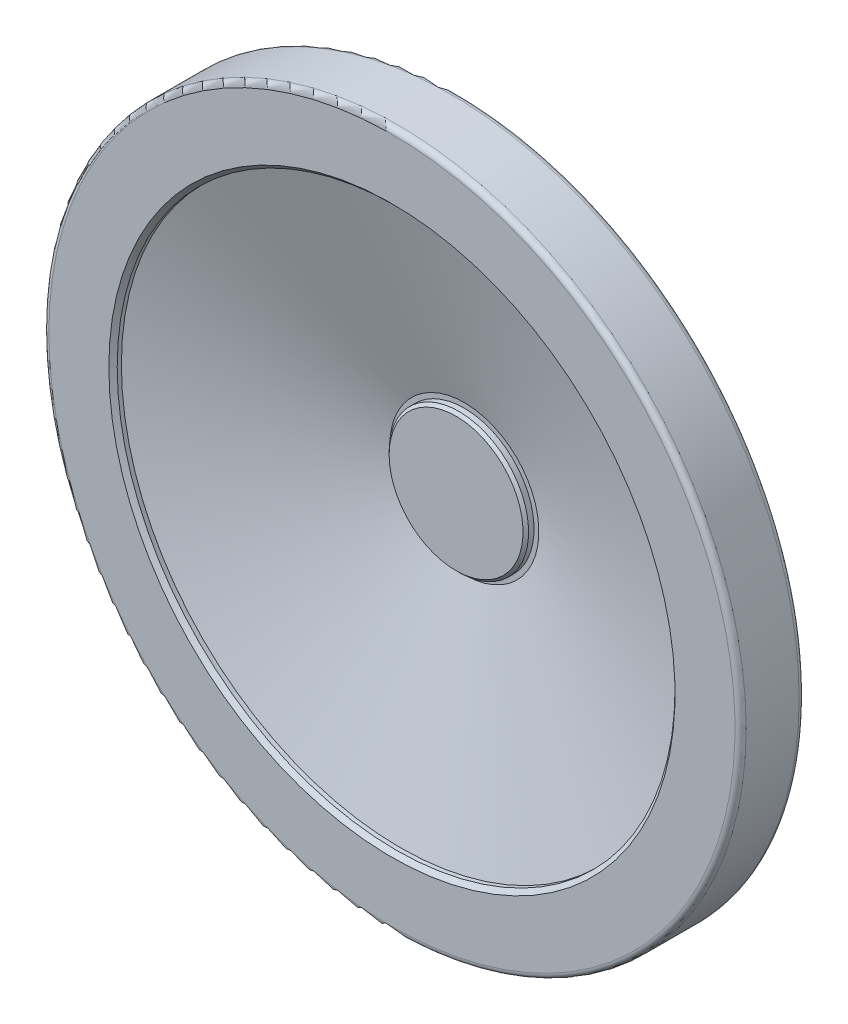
ISO-10303-21;
HEADER;
FILE_DESCRIPTION(('STEP AP214'),'2;1');
FILE_NAME('part.step','',(''),(''),'','','');
FILE_SCHEMA(('AUTOMOTIVE_DESIGN { 1 0 10303 214 1 1 1 1 }'));
ENDSEC;
DATA;
#1=APPLICATION_CONTEXT('core data for automotive mechanical design processes');
#2=APPLICATION_PROTOCOL_DEFINITION('international standard','automotive_design',2000,#1);
#3=PRODUCT_CONTEXT('',#1,'mechanical');
#4=PRODUCT('Part','Part','',(#3));
#5=PRODUCT_RELATED_PRODUCT_CATEGORY('part','',(#4));
#6=PRODUCT_DEFINITION_FORMATION('','',#4);
#7=PRODUCT_DEFINITION_CONTEXT('part definition',#1,'design');
#8=PRODUCT_DEFINITION('design','',#6,#7);
#9=PRODUCT_DEFINITION_SHAPE('','',#8);
#10=(LENGTH_UNIT() NAMED_UNIT(*) SI_UNIT(.MILLI.,.METRE.));
#11=(NAMED_UNIT(*) PLANE_ANGLE_UNIT() SI_UNIT($,.RADIAN.));
#12=(NAMED_UNIT(*) SI_UNIT($,.STERADIAN.) SOLID_ANGLE_UNIT());
#13=UNCERTAINTY_MEASURE_WITH_UNIT(LENGTH_MEASURE(1.E-05),#10,'distance_accuracy_value','');
#14=(GEOMETRIC_REPRESENTATION_CONTEXT(3) GLOBAL_UNCERTAINTY_ASSIGNED_CONTEXT((#13)) GLOBAL_UNIT_ASSIGNED_CONTEXT((#10,
#11,#12)) REPRESENTATION_CONTEXT('',''));
#15=CARTESIAN_POINT('',(0.,0.,0.));
#16=DIRECTION('',(0.,0.,1.));
#17=DIRECTION('',(1.,0.,0.));
#18=AXIS2_PLACEMENT_3D('',#15,#16,#17);
#19=CARTESIAN_POINT('',(0.,0.,17.));
#20=DIRECTION('',(0.,0.,-1.));
#21=DIRECTION('',(1.,0.,0.));
#22=AXIS2_PLACEMENT_3D('',#19,#20,#21);
#23=CONICAL_SURFACE('',#22,2.99999999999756,1.0471975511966);
#24=CARTESIAN_POINT('',(0.,0.,18.732050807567));
#25=VERTEX_POINT('',#24);
#26=VERTEX_LOOP('',#25);
#27=FACE_BOUND('',#26,.T.);
#28=CARTESIAN_POINT('',(0.,0.,17.));
#29=DIRECTION('',(0.,0.,1.));
#30=DIRECTION('',(-1.,0.,0.));
#31=AXIS2_PLACEMENT_3D('',#28,#29,#30);
#32=CIRCLE('',#31,2.99999999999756);
#33=CARTESIAN_POINT('',(-2.99999999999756,0.,17.));
#34=VERTEX_POINT('',#33);
#35=EDGE_CURVE('E9',#34,#34,#32,.T.);
#36=ORIENTED_EDGE('',*,*,#35,.F.);
#37=EDGE_LOOP('',(#36));
#38=FACE_BOUND('',#37,.T.);
#39=ADVANCED_FACE('F14',(#27,#38),#23,.F.);
#40=CARTESIAN_POINT('',(0.,0.,78.));
#41=DIRECTION('',(0.,0.,1.));
#42=DIRECTION('',(-1.,0.,0.));
#43=AXIS2_PLACEMENT_3D('',#40,#41,#42);
#44=CYLINDRICAL_SURFACE('',#43,2.99999999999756);
#45=ORIENTED_EDGE('',*,*,#35,.T.);
#46=EDGE_LOOP('',(#45));
#47=FACE_BOUND('',#46,.T.);
#48=CARTESIAN_POINT('',(0.,0.,0.));
#49=DIRECTION('',(0.,0.,1.));
#50=DIRECTION('',(-1.,0.,0.));
#51=AXIS2_PLACEMENT_3D('',#48,#49,#50);
#52=CIRCLE('',#51,2.99999999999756);
#53=CARTESIAN_POINT('',(-2.99999999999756,0.,0.));
#54=VERTEX_POINT('',#53);
#55=EDGE_CURVE('E20',#54,#54,#52,.T.);
#56=ORIENTED_EDGE('',*,*,#55,.F.);
#57=EDGE_LOOP('',(#56));
#58=FACE_BOUND('',#57,.T.);
#59=ADVANCED_FACE('F25',(#47,#58),#44,.F.);
#60=CARTESIAN_POINT('',(0.,-22.9999999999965,0.));
#61=DIRECTION('',(0.,0.,-1.));
#62=DIRECTION('',(1.,0.,0.));
#63=AXIS2_PLACEMENT_3D('',#60,#61,#62);
#64=PLANE('',#63);
#65=ORIENTED_EDGE('',*,*,#55,.T.);
#66=EDGE_LOOP('',(#65));
#67=FACE_BOUND('',#66,.T.);
#68=CARTESIAN_POINT('',(0.,0.,0.));
#69=DIRECTION('',(0.,0.,1.));
#70=DIRECTION('',(-1.,0.,0.));
#71=AXIS2_PLACEMENT_3D('',#68,#69,#70);
#72=CIRCLE('',#71,22.9999999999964);
#73=CARTESIAN_POINT('',(-22.9999999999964,0.,0.));
#74=VERTEX_POINT('',#73);
#75=EDGE_CURVE('E34',#74,#74,#72,.T.);
#76=ORIENTED_EDGE('',*,*,#75,.F.);
#77=EDGE_LOOP('',(#76));
#78=FACE_BOUND('',#77,.T.);
#79=ADVANCED_FACE('F30',(#67,#78),#64,.T.);
#80=CARTESIAN_POINT('',(0.,0.,0.));
#81=DIRECTION('',(0.,0.,1.));
#82=DIRECTION('',(-1.,0.,0.));
#83=AXIS2_PLACEMENT_3D('',#80,#81,#82);
#84=CONICAL_SURFACE('',#83,22.9999999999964,0.78539816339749);
#85=CARTESIAN_POINT('',(0.,0.,2.));
#86=DIRECTION('',(0.,0.,1.));
#87=DIRECTION('',(-1.,0.,0.));
#88=AXIS2_PLACEMENT_3D('',#85,#86,#87);
#89=CIRCLE('',#88,24.9999999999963);
#90=CARTESIAN_POINT('',(-24.9999999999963,0.,2.));
#91=VERTEX_POINT('',#90);
#92=EDGE_CURVE('E36',#91,#91,#89,.T.);
#93=ORIENTED_EDGE('',*,*,#92,.F.);
#94=EDGE_LOOP('',(#93));
#95=FACE_BOUND('',#94,.T.);
#96=ORIENTED_EDGE('',*,*,#75,.T.);
#97=EDGE_LOOP('',(#96));
#98=FACE_BOUND('',#97,.T.);
#99=ADVANCED_FACE('F169',(#95,#98),#84,.T.);
#100=CARTESIAN_POINT('',(0.,0.,78.));
#101=DIRECTION('',(0.,0.,1.));
#102=DIRECTION('',(-1.,0.,0.));
#103=AXIS2_PLACEMENT_3D('',#100,#101,#102);
#104=CYLINDRICAL_SURFACE('',#103,24.9999999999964);
#105=ORIENTED_EDGE('',*,*,#92,.T.);
#106=EDGE_LOOP('',(#105));
#107=FACE_BOUND('',#106,.T.);
#108=CARTESIAN_POINT('',(0.,0.,23.6));
#109=DIRECTION('',(0.,0.,1.));
#110=DIRECTION('',(-1.,0.,0.));
#111=AXIS2_PLACEMENT_3D('',#108,#109,#110);
#112=CIRCLE('',#111,24.9999999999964);
#113=CARTESIAN_POINT('',(-24.9999999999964,0.,23.6));
#114=VERTEX_POINT('',#113);
#115=EDGE_CURVE('E41',#114,#114,#112,.T.);
#116=ORIENTED_EDGE('',*,*,#115,.F.);
#117=EDGE_LOOP('',(#116));
#118=FACE_BOUND('',#117,.T.);
#119=ADVANCED_FACE('F165',(#107,#118),#104,.T.);
#120=CARTESIAN_POINT('',(0.,0.,23.6));
#121=DIRECTION('',(0.,0.,1.));
#122=DIRECTION('',(-1.,0.,0.));
#123=AXIS2_PLACEMENT_3D('',#120,#121,#122);
#124=TOROIDAL_SURFACE('',#123,25.3999999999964,0.39999999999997);
#125=ORIENTED_EDGE('',*,*,#115,.T.);
#126=EDGE_LOOP('',(#125));
#127=FACE_BOUND('',#126,.T.);
#128=CARTESIAN_POINT('',(0.,0.,24.));
#129=DIRECTION('',(0.,0.,1.));
#130=DIRECTION('',(-1.,0.,0.));
#131=AXIS2_PLACEMENT_3D('',#128,#129,#130);
#132=CIRCLE('',#131,25.3999999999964);
#133=CARTESIAN_POINT('',(-25.3999999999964,0.,24.));
#134=VERTEX_POINT('',#133);
#135=EDGE_CURVE('E44',#134,#134,#132,.T.);
#136=ORIENTED_EDGE('',*,*,#135,.F.);
#137=EDGE_LOOP('',(#136));
#138=FACE_BOUND('',#137,.T.);
#139=ADVANCED_FACE('F161',(#127,#138),#124,.F.);
#140=CARTESIAN_POINT('',(0.,-25.3999999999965,24.));
#141=DIRECTION('',(0.,0.,1.));
#142=DIRECTION('',(-1.,0.,0.));
#143=AXIS2_PLACEMENT_3D('',#140,#141,#142);
#144=PLANE('',#143);
#145=CARTESIAN_POINT('',(0.,0.,24.));
#146=DIRECTION('',(0.,0.,1.));
#147=DIRECTION('',(-1.,0.,0.));
#148=AXIS2_PLACEMENT_3D('',#145,#146,#147);
#149=CIRCLE('',#148,26.9999999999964);
#150=CARTESIAN_POINT('',(-26.9999999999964,0.,24.));
#151=VERTEX_POINT('',#150);
#152=EDGE_CURVE('E47',#151,#151,#149,.T.);
#153=ORIENTED_EDGE('',*,*,#152,.F.);
#154=EDGE_LOOP('',(#153));
#155=FACE_BOUND('',#154,.T.);
#156=ORIENTED_EDGE('',*,*,#135,.T.);
#157=EDGE_LOOP('',(#156));
#158=FACE_BOUND('',#157,.T.);
#159=ADVANCED_FACE('F157',(#155,#158),#144,.F.);
#160=CARTESIAN_POINT('',(0.,0.,78.));
#161=DIRECTION('',(0.,0.,1.));
#162=DIRECTION('',(-1.,0.,0.));
#163=AXIS2_PLACEMENT_3D('',#160,#161,#162);
#164=CYLINDRICAL_SURFACE('',#163,26.9999999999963);
#165=CARTESIAN_POINT('',(0.,0.,24.598901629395));
#166=DIRECTION('',(0.,0.,1.));
#167=DIRECTION('',(-1.,0.,0.));
#168=AXIS2_PLACEMENT_3D('',#165,#166,#167);
#169=CIRCLE('',#168,26.9999999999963);
#170=CARTESIAN_POINT('',(-26.9999999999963,0.,24.598901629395));
#171=VERTEX_POINT('',#170);
#172=EDGE_CURVE('E50',#171,#171,#169,.T.);
#173=ORIENTED_EDGE('',*,*,#172,.F.);
#174=EDGE_LOOP('',(#173));
#175=FACE_BOUND('',#174,.T.);
#176=ORIENTED_EDGE('',*,*,#152,.T.);
#177=EDGE_LOOP('',(#176));
#178=FACE_BOUND('',#177,.T.);
#179=ADVANCED_FACE('F153',(#175,#178),#164,.T.);
#180=CARTESIAN_POINT('',(0.,0.,24.598901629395));
#181=DIRECTION('',(0.,0.,1.));
#182=DIRECTION('',(-1.,0.,0.));
#183=AXIS2_PLACEMENT_3D('',#180,#181,#182);
#184=TOROIDAL_SURFACE('',#183,31.9999999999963,5.);
#185=ORIENTED_EDGE('',*,*,#172,.T.);
#186=EDGE_LOOP('',(#185));
#187=FACE_BOUND('',#186,.T.);
#188=CARTESIAN_POINT('',(0.,0.,29.3327653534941));
#189=DIRECTION('',(0.,0.,1.));
#190=DIRECTION('',(-1.,0.,0.));
#191=AXIS2_PLACEMENT_3D('',#188,#189,#190);
#192=CIRCLE('',#191,30.3904863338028);
#193=CARTESIAN_POINT('',(-30.3904863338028,0.,29.3327653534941));
#194=VERTEX_POINT('',#193);
#195=EDGE_CURVE('E53',#194,#194,#192,.T.);
#196=ORIENTED_EDGE('',*,*,#195,.F.);
#197=EDGE_LOOP('',(#196));
#198=FACE_BOUND('',#197,.T.);
#199=ADVANCED_FACE('F149',(#187,#198),#184,.F.);
#200=CARTESIAN_POINT('',(0.,0.,29.3327653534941));
#201=DIRECTION('',(0.,0.,1.));
#202=DIRECTION('',(-1.,0.,0.));
#203=AXIS2_PLACEMENT_3D('',#200,#201,#202);
#204=CONICAL_SURFACE('',#203,30.3904863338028,1.24305782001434);
#205=CARTESIAN_POINT('',(0.,0.,40.));
#206=DIRECTION('',(0.,0.,1.));
#207=DIRECTION('',(-1.,0.,0.));
#208=AXIS2_PLACEMENT_3D('',#205,#206,#207);
#209=CIRCLE('',#208,61.7647058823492);
#210=CARTESIAN_POINT('',(-61.7647058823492,0.,40.));
#211=VERTEX_POINT('',#210);
#212=EDGE_CURVE('E56',#211,#211,#209,.T.);
#213=ORIENTED_EDGE('',*,*,#212,.F.);
#214=EDGE_LOOP('',(#213));
#215=FACE_BOUND('',#214,.T.);
#216=ORIENTED_EDGE('',*,*,#195,.T.);
#217=EDGE_LOOP('',(#216));
#218=FACE_BOUND('',#217,.T.);
#219=ADVANCED_FACE('F145',(#215,#218),#204,.T.);
#220=CARTESIAN_POINT('',(0.,-122.999999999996,40.));
#221=DIRECTION('',(0.,0.,-1.));
#222=DIRECTION('',(1.,0.,0.));
#223=AXIS2_PLACEMENT_3D('',#220,#221,#222);
#224=PLANE('',#223);
#225=ORIENTED_EDGE('',*,*,#212,.T.);
#226=EDGE_LOOP('',(#225));
#227=FACE_BOUND('',#226,.T.);
#228=CARTESIAN_POINT('',(0.,0.,40.));
#229=DIRECTION('',(0.,0.,1.));
#230=DIRECTION('',(-1.,0.,0.));
#231=AXIS2_PLACEMENT_3D('',#228,#229,#230);
#232=CIRCLE('',#231,122.999999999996);
#233=CARTESIAN_POINT('',(-122.999999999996,0.,40.));
#234=VERTEX_POINT('',#233);
#235=EDGE_CURVE('E59',#234,#234,#232,.T.);
#236=ORIENTED_EDGE('',*,*,#235,.F.);
#237=EDGE_LOOP('',(#236));
#238=FACE_BOUND('',#237,.T.);
#239=ADVANCED_FACE('F141',(#227,#238),#224,.T.);
#240=CARTESIAN_POINT('',(0.,0.,42.));
#241=DIRECTION('',(0.,0.,1.));
#242=DIRECTION('',(-1.,0.,0.));
#243=AXIS2_PLACEMENT_3D('',#240,#241,#242);
#244=TOROIDAL_SURFACE('',#243,122.999999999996,2.);
#245=CARTESIAN_POINT('',(0.,0.,42.));
#246=DIRECTION('',(0.,0.,1.));
#247=DIRECTION('',(-1.,0.,0.));
#248=AXIS2_PLACEMENT_3D('',#245,#246,#247);
#249=CIRCLE('',#248,124.999999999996);
#250=CARTESIAN_POINT('',(-124.999999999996,0.,42.));
#251=VERTEX_POINT('',#250);
#252=EDGE_CURVE('E62',#251,#251,#249,.T.);
#253=ORIENTED_EDGE('',*,*,#252,.F.);
#254=EDGE_LOOP('',(#253));
#255=FACE_BOUND('',#254,.T.);
#256=ORIENTED_EDGE('',*,*,#235,.T.);
#257=EDGE_LOOP('',(#256));
#258=FACE_BOUND('',#257,.T.);
#259=ADVANCED_FACE('F137',(#255,#258),#244,.T.);
#260=CARTESIAN_POINT('',(0.,0.,78.));
#261=DIRECTION('',(0.,0.,1.));
#262=DIRECTION('',(-1.,0.,0.));
#263=AXIS2_PLACEMENT_3D('',#260,#261,#262);
#264=CYLINDRICAL_SURFACE('',#263,124.999999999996);
#265=ORIENTED_EDGE('',*,*,#252,.T.);
#266=EDGE_LOOP('',(#265));
#267=FACE_BOUND('',#266,.T.);
#268=CARTESIAN_POINT('',(0.,0.,61.));
#269=DIRECTION('',(0.,0.,1.));
#270=DIRECTION('',(-1.,0.,0.));
#271=AXIS2_PLACEMENT_3D('',#268,#269,#270);
#272=CIRCLE('',#271,124.999999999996);
#273=CARTESIAN_POINT('',(-124.999999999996,0.,61.));
#274=VERTEX_POINT('',#273);
#275=EDGE_CURVE('E65',#274,#274,#272,.T.);
#276=ORIENTED_EDGE('',*,*,#275,.F.);
#277=EDGE_LOOP('',(#276));
#278=FACE_BOUND('',#277,.T.);
#279=ADVANCED_FACE('F133',(#267,#278),#264,.T.);
#280=CARTESIAN_POINT('',(0.,0.,61.));
#281=DIRECTION('',(0.,0.,1.));
#282=DIRECTION('',(-1.,0.,0.));
#283=AXIS2_PLACEMENT_3D('',#280,#281,#282);
#284=TOROIDAL_SURFACE('',#283,122.999999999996,2.);
#285=CARTESIAN_POINT('',(0.,0.,63.));
#286=DIRECTION('',(0.,0.,1.));
#287=DIRECTION('',(-1.,0.,0.));
#288=AXIS2_PLACEMENT_3D('',#285,#286,#287);
#289=CIRCLE('',#288,122.999999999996);
#290=CARTESIAN_POINT('',(-122.999999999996,0.,63.));
#291=VERTEX_POINT('',#290);
#292=EDGE_CURVE('E68',#291,#291,#289,.T.);
#293=ORIENTED_EDGE('',*,*,#292,.F.);
#294=EDGE_LOOP('',(#293));
#295=FACE_BOUND('',#294,.T.);
#296=ORIENTED_EDGE('',*,*,#275,.T.);
#297=EDGE_LOOP('',(#296));
#298=FACE_BOUND('',#297,.T.);
#299=ADVANCED_FACE('F129',(#295,#298),#284,.T.);
#300=CARTESIAN_POINT('',(0.,-122.999999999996,63.));
#301=DIRECTION('',(0.,0.,-1.));
#302=DIRECTION('',(1.,0.,0.));
#303=AXIS2_PLACEMENT_3D('',#300,#301,#302);
#304=PLANE('',#303);
#305=CARTESIAN_POINT('',(0.,0.,63.));
#306=DIRECTION('',(0.,0.,1.));
#307=DIRECTION('',(-1.,0.,0.));
#308=AXIS2_PLACEMENT_3D('',#305,#306,#307);
#309=CIRCLE('',#308,101.499999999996);
#310=CARTESIAN_POINT('',(-101.499999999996,0.,63.));
#311=VERTEX_POINT('',#310);
#312=EDGE_CURVE('E71',#311,#311,#309,.T.);
#313=ORIENTED_EDGE('',*,*,#312,.F.);
#314=EDGE_LOOP('',(#313));
#315=FACE_BOUND('',#314,.T.);
#316=ORIENTED_EDGE('',*,*,#292,.T.);
#317=EDGE_LOOP('',(#316));
#318=FACE_BOUND('',#317,.T.);
#319=ADVANCED_FACE('F125',(#315,#318),#304,.F.);
#320=CARTESIAN_POINT('',(0.,0.,63.));
#321=DIRECTION('',(0.,0.,1.));
#322=DIRECTION('',(-1.,0.,0.));
#323=AXIS2_PLACEMENT_3D('',#320,#321,#322);
#324=CONICAL_SURFACE('',#323,101.499999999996,0.78539816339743);
#325=CARTESIAN_POINT('',(0.,0.,61.5));
#326=DIRECTION('',(0.,0.,1.));
#327=DIRECTION('',(-1.,0.,0.));
#328=AXIS2_PLACEMENT_3D('',#325,#326,#327);
#329=CIRCLE('',#328,99.9999999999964);
#330=CARTESIAN_POINT('',(-99.9999999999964,0.,61.5));
#331=VERTEX_POINT('',#330);
#332=EDGE_CURVE('E74',#331,#331,#329,.T.);
#333=ORIENTED_EDGE('',*,*,#332,.F.);
#334=EDGE_LOOP('',(#333));
#335=FACE_BOUND('',#334,.T.);
#336=ORIENTED_EDGE('',*,*,#312,.T.);
#337=EDGE_LOOP('',(#336));
#338=FACE_BOUND('',#337,.T.);
#339=ADVANCED_FACE('F121',(#335,#338),#324,.F.);
#340=CARTESIAN_POINT('',(0.,0.,78.));
#341=DIRECTION('',(0.,0.,1.));
#342=DIRECTION('',(-1.,0.,0.));
#343=AXIS2_PLACEMENT_3D('',#340,#341,#342);
#344=CYLINDRICAL_SURFACE('',#343,99.9999999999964);
#345=CARTESIAN_POINT('',(0.,0.,60.));
#346=DIRECTION('',(0.,0.,1.));
#347=DIRECTION('',(-1.,0.,0.));
#348=AXIS2_PLACEMENT_3D('',#345,#346,#347);
#349=CIRCLE('',#348,99.9999999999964);
#350=CARTESIAN_POINT('',(-99.9999999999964,0.,60.));
#351=VERTEX_POINT('',#350);
#352=EDGE_CURVE('E77',#351,#351,#349,.T.);
#353=ORIENTED_EDGE('',*,*,#352,.F.);
#354=EDGE_LOOP('',(#353));
#355=FACE_BOUND('',#354,.T.);
#356=ORIENTED_EDGE('',*,*,#332,.T.);
#357=EDGE_LOOP('',(#356));
#358=FACE_BOUND('',#357,.T.);
#359=ADVANCED_FACE('F117',(#355,#358),#344,.F.);
#360=CARTESIAN_POINT('',(0.,0.,60.));
#361=DIRECTION('',(0.,0.,1.));
#362=DIRECTION('',(-1.,0.,0.));
#363=AXIS2_PLACEMENT_3D('',#360,#361,#362);
#364=CONICAL_SURFACE('',#363,99.9999999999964,1.26715244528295);
#365=CARTESIAN_POINT('',(0.,0.,37.041909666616));
#366=DIRECTION('',(0.,0.,1.));
#367=DIRECTION('',(-1.,0.,0.));
#368=AXIS2_PLACEMENT_3D('',#365,#366,#367);
#369=CIRCLE('',#368,26.7294989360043);
#370=CARTESIAN_POINT('',(-26.7294989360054,0.,37.041909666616));
#371=VERTEX_POINT('',#370);
#372=EDGE_CURVE('E80',#371,#371,#369,.T.);
#373=CARTESIAN_POINT('',(-26.7294989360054,0.,37.041909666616));
#374=CARTESIAN_POINT('',(-27.4927333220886,0.,37.2810564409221));
#375=CARTESIAN_POINT('',(-28.2559677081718,0.,37.5202032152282));
#376=CARTESIAN_POINT('',(-29.7824364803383,0.,37.9984967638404));
#377=CARTESIAN_POINT('',(-30.5456708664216,0.,38.2376435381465));
#378=CARTESIAN_POINT('',(-32.072139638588,0.,38.7159370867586));
#379=CARTESIAN_POINT('',(-32.8353740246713,0.,38.9550838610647));
#380=CARTESIAN_POINT('',(-34.3618427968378,0.,39.4333774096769));
#381=CARTESIAN_POINT('',(-35.125077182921,0.,39.672524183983));
#382=CARTESIAN_POINT('',(-36.6515459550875,0.,40.1508177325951));
#383=CARTESIAN_POINT('',(-37.4147803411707,0.,40.3899645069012));
#384=CARTESIAN_POINT('',(-38.9412491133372,0.,40.8682580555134));
#385=CARTESIAN_POINT('',(-39.7044834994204,0.,41.1074048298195));
#386=CARTESIAN_POINT('',(-41.2309522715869,0.,41.5856983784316));
#387=CARTESIAN_POINT('',(-41.9941866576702,0.,41.8248451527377));
#388=CARTESIAN_POINT('',(-43.5206554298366,0.,42.3031387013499));
#389=CARTESIAN_POINT('',(-44.2838898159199,0.,42.542285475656));
#390=CARTESIAN_POINT('',(-45.8103585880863,0.,43.0205790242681));
#391=CARTESIAN_POINT('',(-46.5735929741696,0.,43.2597257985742));
#392=CARTESIAN_POINT('',(-48.1000617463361,0.,43.7380193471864));
#393=CARTESIAN_POINT('',(-48.8632961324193,0.,43.9771661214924));
#394=CARTESIAN_POINT('',(-50.3897649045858,0.,44.4554596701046));
#395=CARTESIAN_POINT('',(-51.152999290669,0.,44.6946064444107));
#396=CARTESIAN_POINT('',(-52.6794680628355,0.,45.1728999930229));
#397=CARTESIAN_POINT('',(-53.4427024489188,0.,45.4120467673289));
#398=CARTESIAN_POINT('',(-54.9691712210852,0.,45.8903403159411));
#399=CARTESIAN_POINT('',(-55.7324056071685,0.,46.1294870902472));
#400=CARTESIAN_POINT('',(-57.258874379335,0.,46.6077806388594));
#401=CARTESIAN_POINT('',(-58.0221087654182,0.,46.8469274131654));
#402=CARTESIAN_POINT('',(-59.5485775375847,0.,47.3252209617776));
#403=CARTESIAN_POINT('',(-60.3118119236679,0.,47.5643677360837));
#404=CARTESIAN_POINT('',(-61.8382806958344,0.,48.0426612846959));
#405=CARTESIAN_POINT('',(-62.6015150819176,0.,48.2818080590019));
#406=CARTESIAN_POINT('',(-64.1279838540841,0.,48.7601016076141));
#407=CARTESIAN_POINT('',(-64.8912182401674,0.,48.9992483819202));
#408=CARTESIAN_POINT('',(-66.4176870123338,0.,49.4775419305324));
#409=CARTESIAN_POINT('',(-67.1809213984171,0.,49.7166887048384));
#410=CARTESIAN_POINT('',(-68.7073901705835,0.,50.1949822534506));
#411=CARTESIAN_POINT('',(-69.4706245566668,0.,50.4341290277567));
#412=CARTESIAN_POINT('',(-70.9970933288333,0.,50.9124225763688));
#413=CARTESIAN_POINT('',(-71.7603277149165,0.,51.1515693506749));
#414=CARTESIAN_POINT('',(-73.286796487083,0.,51.6298628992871));
#415=CARTESIAN_POINT('',(-74.0500308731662,0.,51.8690096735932));
#416=CARTESIAN_POINT('',(-75.5764996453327,0.,52.3473032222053));
#417=CARTESIAN_POINT('',(-76.3397340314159,0.,52.5864499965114));
#418=CARTESIAN_POINT('',(-77.8662028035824,0.,53.0647435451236));
#419=CARTESIAN_POINT('',(-78.6294371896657,0.,53.3038903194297));
#420=CARTESIAN_POINT('',(-80.1559059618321,0.,53.7821838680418));
#421=CARTESIAN_POINT('',(-80.9191403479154,0.,54.0213306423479));
#422=CARTESIAN_POINT('',(-82.4456091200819,0.,54.4996241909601));
#423=CARTESIAN_POINT('',(-83.2088435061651,0.,54.7387709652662));
#424=CARTESIAN_POINT('',(-84.7353122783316,0.,55.2170645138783));
#425=CARTESIAN_POINT('',(-85.4985466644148,0.,55.4562112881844));
#426=CARTESIAN_POINT('',(-87.0250154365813,0.,55.9345048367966));
#427=CARTESIAN_POINT('',(-87.7882498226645,0.,56.1736516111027));
#428=CARTESIAN_POINT('',(-89.314718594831,0.,56.6519451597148));
#429=CARTESIAN_POINT('',(-90.0779529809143,0.,56.8910919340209));
#430=CARTESIAN_POINT('',(-91.6044217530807,0.,57.3693854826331));
#431=CARTESIAN_POINT('',(-92.367656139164,0.,57.6085322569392));
#432=CARTESIAN_POINT('',(-93.8941249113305,0.,58.0868258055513));
#433=CARTESIAN_POINT('',(-94.6573592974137,0.,58.3259725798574));
#434=CARTESIAN_POINT('',(-96.1838280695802,0.,58.8042661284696));
#435=CARTESIAN_POINT('',(-96.9470624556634,0.,59.0434129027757));
#436=CARTESIAN_POINT('',(-98.4735312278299,0.,59.5217064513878));
#437=CARTESIAN_POINT('',(-99.2367656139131,0.,59.7608532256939));
#438=CARTESIAN_POINT('',(-99.9999999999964,0.,60.));
#439=B_SPLINE_CURVE_WITH_KNOTS('',3,(#373,#374,#375,#376,#377,#378,#379,#380,#381,#382,#383,
#384,#385,#386,#387,#388,#389,#390,#391,#392,#393,#394,#395,#396,#397,#398,#399,#400,#401,#402,
#403,#404,#405,#406,#407,#408,#409,#410,#411,#412,#413,#414,#415,#416,#417,#418,#419,#420,#421,
#422,#423,#424,#425,#426,#427,#428,#429,#430,#431,#432,#433,#434,#435,#436,#437,#438),
.UNSPECIFIED.,.F.,.F.,(4,2,2,2,2,2,2,2,2,2,2,2,2,2,2,2,2,2,2,2,2,2,2,2,2,2,2,2,2,2,2,2,4),(0.,
2.39947101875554,4.79894203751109,7.19841305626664,9.59788407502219,11.9973550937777,
14.3968261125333,16.7962971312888,19.1957681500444,21.5952391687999,23.9947101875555,
26.394181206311,28.7936522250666,31.1931232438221,33.5925942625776,35.9920652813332,
38.3915363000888,40.7910073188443,43.1904783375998,45.5899493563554,47.9894203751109,
50.3888913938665,52.788362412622,55.1878334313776,57.5873044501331,59.9867754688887,
62.3862464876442,64.7857175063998,67.1851885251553,69.5846595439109,71.9841305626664,
74.383601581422,76.7830726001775),.UNSPECIFIED.);
#440=EDGE_CURVE('BSEAM113',#371,#351,#439,.T.);
#441=ORIENTED_EDGE('',*,*,#372,.F.);
#442=ORIENTED_EDGE('',*,*,#352,.T.);
#443=ORIENTED_EDGE('',*,*,#440,.T.);
#444=ORIENTED_EDGE('',*,*,#440,.F.);
#445=EDGE_LOOP('',(#441,#443,#442,#444));
#446=FACE_BOUND('',#445,.T.);
#447=ADVANCED_FACE('F113',(#446),#364,.F.);
#448=CARTESIAN_POINT('',(0.,-26.7294989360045,37.041909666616));
#449=DIRECTION('',(0.,0.,-1.));
#450=DIRECTION('',(1.,0.,0.));
#451=AXIS2_PLACEMENT_3D('',#448,#449,#450);
#452=PLANE('',#451);
#453=CARTESIAN_POINT('',(0.,0.,37.041909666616));
#454=DIRECTION('',(0.,0.,1.));
#455=DIRECTION('',(-1.,0.,0.));
#456=AXIS2_PLACEMENT_3D('',#453,#454,#455);
#457=CIRCLE('',#456,24.9999999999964);
#458=CARTESIAN_POINT('',(-24.9999999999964,0.,37.041909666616));
#459=VERTEX_POINT('',#458);
#460=EDGE_CURVE('E83',#459,#459,#457,.T.);
#461=ORIENTED_EDGE('',*,*,#460,.F.);
#462=EDGE_LOOP('',(#461));
#463=FACE_BOUND('',#462,.T.);
#464=ORIENTED_EDGE('',*,*,#372,.T.);
#465=EDGE_LOOP('',(#464));
#466=FACE_BOUND('',#465,.T.);
#467=ADVANCED_FACE('F107',(#463,#466),#452,.F.);
#468=CARTESIAN_POINT('',(0.,0.,78.));
#469=DIRECTION('',(0.,0.,1.));
#470=DIRECTION('',(-1.,0.,0.));
#471=AXIS2_PLACEMENT_3D('',#468,#469,#470);
#472=CYLINDRICAL_SURFACE('',#471,24.9999999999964);
#473=CARTESIAN_POINT('',(0.,0.,39.));
#474=DIRECTION('',(0.,0.,1.));
#475=DIRECTION('',(-1.,0.,0.));
#476=AXIS2_PLACEMENT_3D('',#473,#474,#475);
#477=CIRCLE('',#476,24.9999999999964);
#478=CARTESIAN_POINT('',(-24.9999999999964,0.,39.));
#479=VERTEX_POINT('',#478);
#480=EDGE_CURVE('E86',#479,#479,#477,.T.);
#481=ORIENTED_EDGE('',*,*,#480,.F.);
#482=EDGE_LOOP('',(#481));
#483=FACE_BOUND('',#482,.T.);
#484=ORIENTED_EDGE('',*,*,#460,.T.);
#485=EDGE_LOOP('',(#484));
#486=FACE_BOUND('',#485,.T.);
#487=ADVANCED_FACE('F97',(#483,#486),#472,.T.);
#488=CARTESIAN_POINT('',(0.,0.,40.));
#489=DIRECTION('',(0.,0.,-1.));
#490=DIRECTION('',(1.,0.,0.));
#491=AXIS2_PLACEMENT_3D('',#488,#489,#490);
#492=CONICAL_SURFACE('',#491,23.9999999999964,0.785398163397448);
#493=ORIENTED_EDGE('',*,*,#480,.T.);
#494=EDGE_LOOP('',(#493));
#495=FACE_BOUND('',#494,.T.);
#496=CARTESIAN_POINT('',(0.,0.,40.));
#497=DIRECTION('',(0.,0.,1.));
#498=DIRECTION('',(-1.,0.,0.));
#499=AXIS2_PLACEMENT_3D('',#496,#497,#498);
#500=CIRCLE('',#499,23.9999999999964);
#501=CARTESIAN_POINT('',(-23.9999999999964,0.,40.));
#502=VERTEX_POINT('',#501);
#503=EDGE_CURVE('E89',#502,#502,#500,.T.);
#504=ORIENTED_EDGE('',*,*,#503,.F.);
#505=EDGE_LOOP('',(#504));
#506=FACE_BOUND('',#505,.T.);
#507=ADVANCED_FACE('F95',(#495,#506),#492,.T.);
#508=CARTESIAN_POINT('',(0.,-23.9999999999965,40.));
#509=DIRECTION('',(0.,0.,-1.));
#510=DIRECTION('',(1.,0.,0.));
#511=AXIS2_PLACEMENT_3D('',#508,#509,#510);
#512=PLANE('',#511);
#513=ORIENTED_EDGE('',*,*,#503,.T.);
#514=EDGE_LOOP('',(#513));
#515=FACE_BOUND('',#514,.T.);
#516=ADVANCED_FACE('F93',(#515),#512,.F.);
#517=CLOSED_SHELL('',(#39,#59,#79,#99,#119,#139,#159,#179,#199,#219,#239,#259,#279,#299,#319,
#339,#359,#447,#467,#487,#507,#516));
#518=MANIFOLD_SOLID_BREP('B1',#517);
#519=ADVANCED_BREP_SHAPE_REPRESENTATION('',(#18,#518),#14);
#520=SHAPE_DEFINITION_REPRESENTATION(#9,#519);
ENDSEC;
END-ISO-10303-21;
